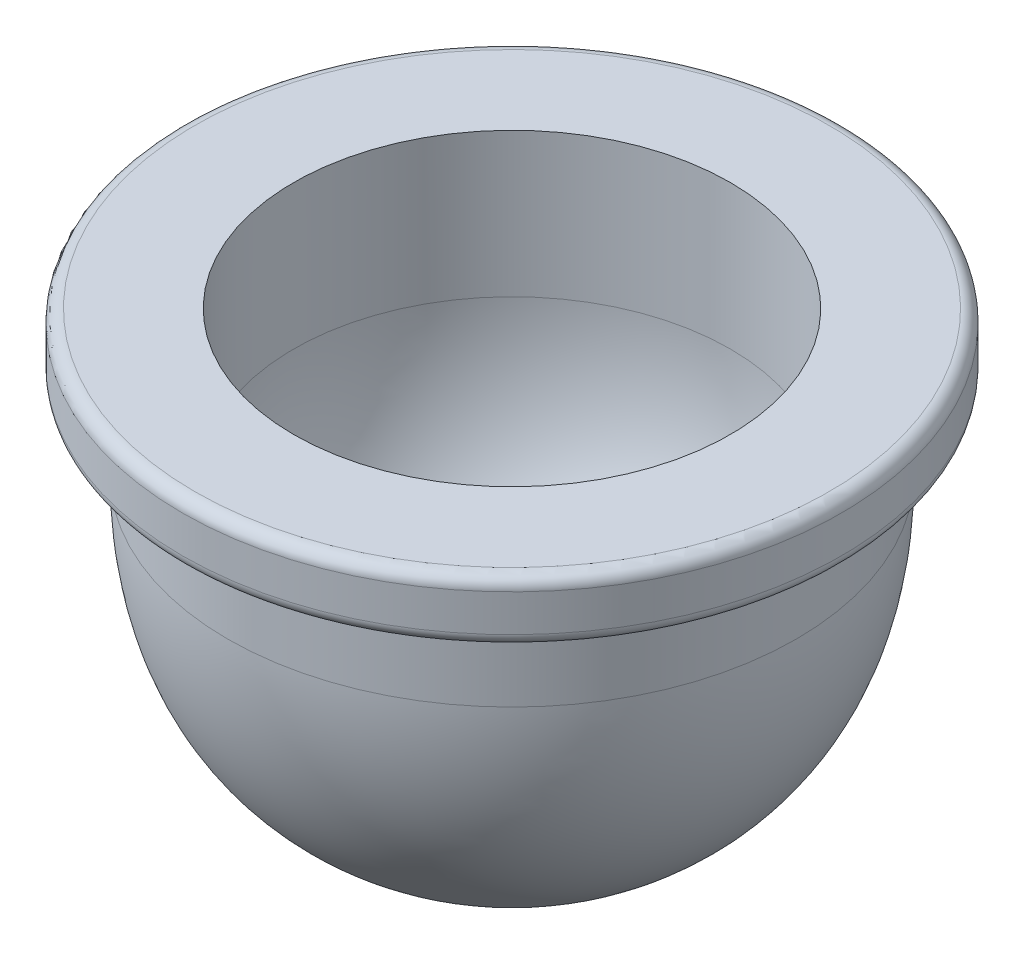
ISO-10303-21;
HEADER;
FILE_DESCRIPTION(('STEP AP214'),'2;1');
FILE_NAME('part.step','',(''),(''),'','','');
FILE_SCHEMA(('AUTOMOTIVE_DESIGN { 1 0 10303 214 1 1 1 1 }'));
ENDSEC;
DATA;
#1=APPLICATION_CONTEXT('core data for automotive mechanical design processes');
#2=APPLICATION_PROTOCOL_DEFINITION('international standard','automotive_design',2000,#1);
#3=PRODUCT_CONTEXT('',#1,'mechanical');
#4=PRODUCT('Part','Part','',(#3));
#5=PRODUCT_RELATED_PRODUCT_CATEGORY('part','',(#4));
#6=PRODUCT_DEFINITION_FORMATION('','',#4);
#7=PRODUCT_DEFINITION_CONTEXT('part definition',#1,'design');
#8=PRODUCT_DEFINITION('design','',#6,#7);
#9=PRODUCT_DEFINITION_SHAPE('','',#8);
#10=(LENGTH_UNIT() NAMED_UNIT(*) SI_UNIT(.MILLI.,.METRE.));
#11=(NAMED_UNIT(*) PLANE_ANGLE_UNIT() SI_UNIT($,.RADIAN.));
#12=(NAMED_UNIT(*) SI_UNIT($,.STERADIAN.) SOLID_ANGLE_UNIT());
#13=UNCERTAINTY_MEASURE_WITH_UNIT(LENGTH_MEASURE(1.E-05),#10,'distance_accuracy_value','');
#14=(GEOMETRIC_REPRESENTATION_CONTEXT(3) GLOBAL_UNCERTAINTY_ASSIGNED_CONTEXT((#13)) GLOBAL_UNIT_ASSIGNED_CONTEXT((#10,
#11,#12)) REPRESENTATION_CONTEXT('',''));
#15=CARTESIAN_POINT('',(0.,0.,0.));
#16=DIRECTION('',(0.,0.,1.));
#17=DIRECTION('',(1.,0.,0.));
#18=AXIS2_PLACEMENT_3D('',#15,#16,#17);
#19=CARTESIAN_POINT('',(0.,-11.,0.));
#20=CARTESIAN_POINT('',(3.39705755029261,-11.,0.));
#21=CARTESIAN_POINT('',(6.89999998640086,-8.64267153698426,0.));
#22=CARTESIAN_POINT('',(6.89999998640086,-3.5,0.));
#23=B_SPLINE_CURVE_WITH_KNOTS('',3,(#19,#20,#21,#22),.UNSPECIFIED.,.F.,.F.,(4,4),(0.,1.),.UNSPECIFIED.);
#24=CARTESIAN_POINT('',(0.,-11.,0.));
#25=DIRECTION('',(0.,-1.,0.));
#26=AXIS1_PLACEMENT('',#24,#25);
#27=SURFACE_OF_REVOLUTION('',#23,#26);
#28=CARTESIAN_POINT('',(0.,-3.5,0.));
#29=DIRECTION('',(0.,-1.,0.));
#30=DIRECTION('',(0.,0.,-1.));
#31=AXIS2_PLACEMENT_3D('',#28,#29,#30);
#32=CIRCLE('',#31,6.89999998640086);
#33=CARTESIAN_POINT('',(0.,-3.5,-6.89999998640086));
#34=VERTEX_POINT('',#33);
#35=EDGE_CURVE('E67',#34,#34,#32,.T.);
#36=ORIENTED_EDGE('',*,*,#35,.T.);
#37=EDGE_LOOP('',(#36));
#38=FACE_BOUND('',#37,.T.);
#39=CARTESIAN_POINT('',(0.,-11.,0.));
#40=VERTEX_POINT('',#39);
#41=VERTEX_LOOP('',#40);
#42=FACE_BOUND('',#41,.T.);
#43=ADVANCED_FACE('F30',(#38,#42),#27,.F.);
#44=CARTESIAN_POINT('',(0.,-11.,0.));
#45=DIRECTION('',(0.,-1.,0.));
#46=DIRECTION('',(0.,0.,-1.));
#47=AXIS2_PLACEMENT_3D('',#44,#45,#46);
#48=CYLINDRICAL_SURFACE('',#47,6.89999999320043);
#49=CARTESIAN_POINT('',(0.,-1.5,0.));
#50=DIRECTION('',(0.,-1.,0.));
#51=DIRECTION('',(0.,0.,-1.));
#52=AXIS2_PLACEMENT_3D('',#49,#50,#51);
#53=CIRCLE('',#52,6.9);
#54=CARTESIAN_POINT('',(0.,-1.5,-6.9));
#55=VERTEX_POINT('',#54);
#56=EDGE_CURVE('E57',#55,#55,#53,.T.);
#57=ORIENTED_EDGE('',*,*,#56,.T.);
#58=EDGE_LOOP('',(#57));
#59=FACE_BOUND('',#58,.T.);
#60=ORIENTED_EDGE('',*,*,#35,.F.);
#61=EDGE_LOOP('',(#60));
#62=FACE_BOUND('',#61,.T.);
#63=ADVANCED_FACE('F88',(#59,#62),#48,.T.);
#64=CARTESIAN_POINT('',(8.,-1.5,0.));
#65=DIRECTION('',(0.,-1.,0.));
#66=DIRECTION('',(0.,0.,-1.));
#67=AXIS2_PLACEMENT_3D('',#64,#65,#66);
#68=PLANE('',#67);
#69=CARTESIAN_POINT('',(0.,-1.5,0.));
#70=DIRECTION('',(0.,-1.,0.));
#71=DIRECTION('',(0.,0.,-1.));
#72=AXIS2_PLACEMENT_3D('',#69,#70,#71);
#73=CIRCLE('',#72,7.7);
#74=CARTESIAN_POINT('',(0.,-1.5,-7.7));
#75=VERTEX_POINT('',#74);
#76=EDGE_CURVE('E70',#75,#75,#73,.T.);
#77=ORIENTED_EDGE('',*,*,#76,.T.);
#78=EDGE_LOOP('',(#77));
#79=FACE_BOUND('',#78,.T.);
#80=ORIENTED_EDGE('',*,*,#56,.F.);
#81=EDGE_LOOP('',(#80));
#82=FACE_BOUND('',#81,.T.);
#83=ADVANCED_FACE('F85',(#79,#82),#68,.T.);
#84=CARTESIAN_POINT('',(0.,-11.,0.));
#85=DIRECTION('',(0.,-1.,0.));
#86=DIRECTION('',(0.,0.,-1.));
#87=AXIS2_PLACEMENT_3D('',#84,#85,#86);
#88=CYLINDRICAL_SURFACE('',#87,8.);
#89=CARTESIAN_POINT('',(0.,-1.2,0.));
#90=DIRECTION('',(0.,-1.,0.));
#91=DIRECTION('',(0.,0.,-1.));
#92=AXIS2_PLACEMENT_3D('',#89,#90,#91);
#93=CIRCLE('',#92,8.);
#94=CARTESIAN_POINT('',(0.,-1.2,-8.));
#95=VERTEX_POINT('',#94);
#96=EDGE_CURVE('E38',#95,#95,#93,.F.);
#97=ORIENTED_EDGE('',*,*,#96,.T.);
#98=EDGE_LOOP('',(#97));
#99=FACE_BOUND('',#98,.T.);
#100=CARTESIAN_POINT('',(0.,-0.3,0.));
#101=DIRECTION('',(0.,1.,0.));
#102=DIRECTION('',(0.,0.,1.));
#103=AXIS2_PLACEMENT_3D('',#100,#101,#102);
#104=CIRCLE('',#103,8.);
#105=CARTESIAN_POINT('',(0.,-0.3,8.));
#106=VERTEX_POINT('',#105);
#107=EDGE_CURVE('E73',#106,#106,#104,.F.);
#108=ORIENTED_EDGE('',*,*,#107,.T.);
#109=EDGE_LOOP('',(#108));
#110=FACE_BOUND('',#109,.T.);
#111=ADVANCED_FACE('F78',(#99,#110),#88,.T.);
#112=CARTESIAN_POINT('',(5.3,0.,0.));
#113=DIRECTION('',(0.,1.,0.));
#114=DIRECTION('',(0.,0.,1.));
#115=AXIS2_PLACEMENT_3D('',#112,#113,#114);
#116=PLANE('',#115);
#117=CARTESIAN_POINT('',(0.,0.,0.));
#118=DIRECTION('',(0.,1.,0.));
#119=DIRECTION('',(0.,0.,1.));
#120=AXIS2_PLACEMENT_3D('',#117,#118,#119);
#121=CIRCLE('',#120,7.7);
#122=CARTESIAN_POINT('',(0.,0.,7.7));
#123=VERTEX_POINT('',#122);
#124=EDGE_CURVE('E11',#123,#123,#121,.T.);
#125=ORIENTED_EDGE('',*,*,#124,.T.);
#126=EDGE_LOOP('',(#125));
#127=FACE_BOUND('',#126,.T.);
#128=CARTESIAN_POINT('',(0.,0.,0.));
#129=DIRECTION('',(0.,-1.,0.));
#130=DIRECTION('',(0.,0.,-1.));
#131=AXIS2_PLACEMENT_3D('',#128,#129,#130);
#132=CIRCLE('',#131,5.3);
#133=CARTESIAN_POINT('',(0.,0.,-5.3));
#134=VERTEX_POINT('',#133);
#135=EDGE_CURVE('E54',#134,#134,#132,.T.);
#136=ORIENTED_EDGE('',*,*,#135,.T.);
#137=EDGE_LOOP('',(#136));
#138=FACE_BOUND('',#137,.T.);
#139=ADVANCED_FACE('F110',(#127,#138),#116,.T.);
#140=CARTESIAN_POINT('',(0.,-11.,0.));
#141=DIRECTION('',(0.,-1.,0.));
#142=DIRECTION('',(0.,0.,-1.));
#143=AXIS2_PLACEMENT_3D('',#140,#141,#142);
#144=CYLINDRICAL_SURFACE('',#143,5.29999999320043);
#145=CARTESIAN_POINT('',(0.,-3.5,0.));
#146=DIRECTION('',(0.,-1.,0.));
#147=DIRECTION('',(0.,0.,-1.));
#148=AXIS2_PLACEMENT_3D('',#145,#146,#147);
#149=CIRCLE('',#148,5.29999998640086);
#150=CARTESIAN_POINT('',(0.,-3.5,-5.29999998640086));
#151=VERTEX_POINT('',#150);
#152=EDGE_CURVE('E52',#151,#151,#149,.T.);
#153=ORIENTED_EDGE('',*,*,#152,.T.);
#154=EDGE_LOOP('',(#153));
#155=FACE_BOUND('',#154,.T.);
#156=ORIENTED_EDGE('',*,*,#135,.F.);
#157=EDGE_LOOP('',(#156));
#158=FACE_BOUND('',#157,.T.);
#159=ADVANCED_FACE('F48',(#155,#158),#144,.F.);
#160=CARTESIAN_POINT('',(5.29999998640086,-3.5,0.));
#161=CARTESIAN_POINT('',(5.29999998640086,-3.76387415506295,0.));
#162=CARTESIAN_POINT('',(5.27650879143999,-4.30849026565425,0.));
#163=CARTESIAN_POINT('',(5.14577634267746,-5.25694998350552,0.));
#164=CARTESIAN_POINT('',(4.84442018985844,-6.28357356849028,0.));
#165=CARTESIAN_POINT('',(4.31283462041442,-7.26646796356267,0.));
#166=CARTESIAN_POINT('',(3.42038829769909,-8.30642989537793,0.));
#167=CARTESIAN_POINT('',(2.00322428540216,-9.16605057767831,0.));
#168=CARTESIAN_POINT('',(0.660558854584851,-9.4,0.));
#169=CARTESIAN_POINT('',(0.,-9.4,0.));
#170=B_SPLINE_CURVE_WITH_KNOTS('',3,(#160,#161,#162,#163,#164,#165,#166,#167,#168,#169),
.UNSPECIFIED.,.F.,.F.,(4,1,1,1,1,1,1,4),(0.,0.0625,0.125,0.25,0.375,0.5,0.75,1.),.UNSPECIFIED.);
#171=CARTESIAN_POINT('',(0.,-11.,0.));
#172=DIRECTION('',(0.,-1.,0.));
#173=AXIS1_PLACEMENT('',#171,#172);
#174=SURFACE_OF_REVOLUTION('',#170,#173);
#175=CARTESIAN_POINT('',(0.,-9.4,0.));
#176=VERTEX_POINT('',#175);
#177=VERTEX_LOOP('',#176);
#178=FACE_BOUND('',#177,.T.);
#179=ORIENTED_EDGE('',*,*,#152,.F.);
#180=EDGE_LOOP('',(#179));
#181=FACE_BOUND('',#180,.T.);
#182=ADVANCED_FACE('F44',(#178,#181),#174,.F.);
#183=CARTESIAN_POINT('',(0.,-1.2,0.));
#184=DIRECTION('',(0.,-1.,0.));
#185=DIRECTION('',(0.,0.,-1.));
#186=AXIS2_PLACEMENT_3D('',#183,#184,#185);
#187=TOROIDAL_SURFACE('',#186,7.7,0.3);
#188=ORIENTED_EDGE('',*,*,#96,.F.);
#189=EDGE_LOOP('',(#188));
#190=FACE_BOUND('',#189,.T.);
#191=ORIENTED_EDGE('',*,*,#76,.F.);
#192=EDGE_LOOP('',(#191));
#193=FACE_BOUND('',#192,.T.);
#194=ADVANCED_FACE('F47',(#190,#193),#187,.T.);
#195=CARTESIAN_POINT('',(0.,-0.3,0.));
#196=DIRECTION('',(0.,1.,0.));
#197=DIRECTION('',(0.,0.,1.));
#198=AXIS2_PLACEMENT_3D('',#195,#196,#197);
#199=TOROIDAL_SURFACE('',#198,7.7,0.3);
#200=ORIENTED_EDGE('',*,*,#124,.F.);
#201=EDGE_LOOP('',(#200));
#202=FACE_BOUND('',#201,.T.);
#203=ORIENTED_EDGE('',*,*,#107,.F.);
#204=EDGE_LOOP('',(#203));
#205=FACE_BOUND('',#204,.T.);
#206=ADVANCED_FACE('F32',(#202,#205),#199,.T.);
#207=CLOSED_SHELL('',(#43,#63,#83,#111,#139,#159,#182,#194,#206));
#208=MANIFOLD_SOLID_BREP('B2',#207);
#209=ADVANCED_BREP_SHAPE_REPRESENTATION('',(#18,#208),#14);
#210=SHAPE_DEFINITION_REPRESENTATION(#9,#209);
ENDSEC;
END-ISO-10303-21;
